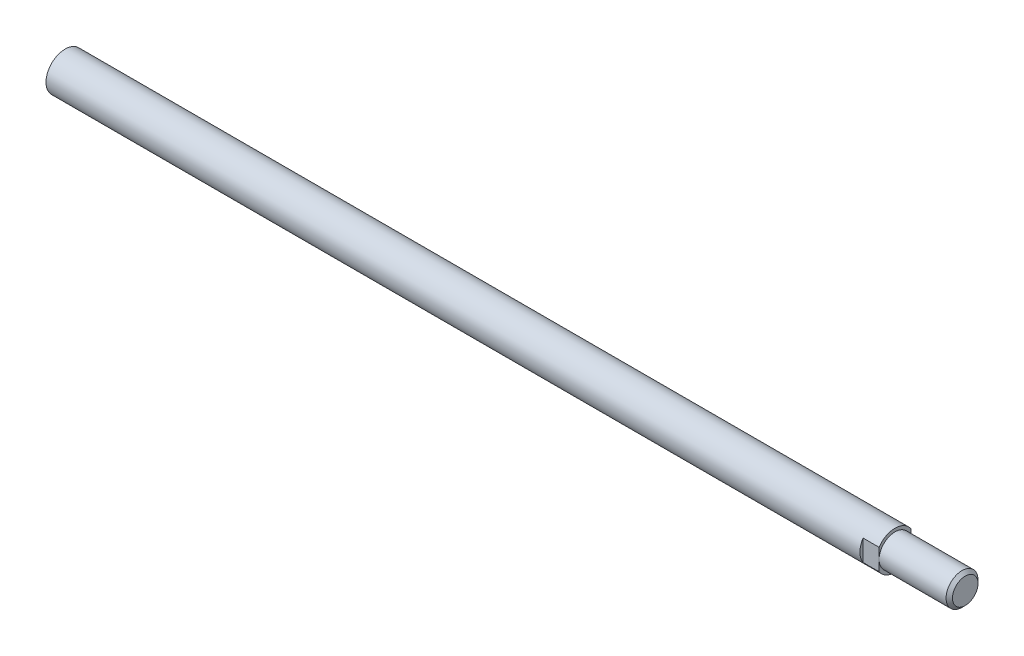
ISO-10303-21;
HEADER;
FILE_DESCRIPTION(('STEP AP214'),'2;1');
FILE_NAME('part.step','',(''),(''),'','','');
FILE_SCHEMA(('AUTOMOTIVE_DESIGN { 1 0 10303 214 1 1 1 1 }'));
ENDSEC;
DATA;
#1=APPLICATION_CONTEXT('core data for automotive mechanical design processes');
#2=APPLICATION_PROTOCOL_DEFINITION('international standard','automotive_design',2000,#1);
#3=PRODUCT_CONTEXT('',#1,'mechanical');
#4=PRODUCT('Part','Part','',(#3));
#5=PRODUCT_RELATED_PRODUCT_CATEGORY('part','',(#4));
#6=PRODUCT_DEFINITION_FORMATION('','',#4);
#7=PRODUCT_DEFINITION_CONTEXT('part definition',#1,'design');
#8=PRODUCT_DEFINITION('design','',#6,#7);
#9=PRODUCT_DEFINITION_SHAPE('','',#8);
#10=(LENGTH_UNIT() NAMED_UNIT(*) SI_UNIT(.MILLI.,.METRE.));
#11=(NAMED_UNIT(*) PLANE_ANGLE_UNIT() SI_UNIT($,.RADIAN.));
#12=(NAMED_UNIT(*) SI_UNIT($,.STERADIAN.) SOLID_ANGLE_UNIT());
#13=UNCERTAINTY_MEASURE_WITH_UNIT(LENGTH_MEASURE(1.E-05),#10,'distance_accuracy_value','');
#14=(GEOMETRIC_REPRESENTATION_CONTEXT(3) GLOBAL_UNCERTAINTY_ASSIGNED_CONTEXT((#13)) GLOBAL_UNIT_ASSIGNED_CONTEXT((#10,
#11,#12)) REPRESENTATION_CONTEXT('',''));
#15=CARTESIAN_POINT('',(0.,0.,0.));
#16=DIRECTION('',(0.,0.,1.));
#17=DIRECTION('',(1.,0.,0.));
#18=AXIS2_PLACEMENT_3D('',#15,#16,#17);
#19=CARTESIAN_POINT('',(0.,5.,0.));
#20=DIRECTION('',(1.,0.,0.));
#21=DIRECTION('',(0.,1.,0.));
#22=AXIS2_PLACEMENT_3D('',#19,#20,#21);
#23=PLANE('',#22);
#24=DIRECTION('',(0.,1.,0.));
#25=VECTOR('',#24,1.);
#26=CARTESIAN_POINT('',(0.,-6.,5.));
#27=LINE('',#26,#25);
#28=CARTESIAN_POINT('',(0.,-3.3166247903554,5.));
#29=VERTEX_POINT('',#28);
#30=CARTESIAN_POINT('',(0.,0.,5.));
#31=VERTEX_POINT('',#30);
#32=EDGE_CURVE('E82',#29,#31,#27,.T.);
#33=ORIENTED_EDGE('',*,*,#32,.F.);
#34=CARTESIAN_POINT('',(0.,0.,0.));
#35=DIRECTION('',(1.,0.,0.));
#36=DIRECTION('',(0.,1.,0.));
#37=AXIS2_PLACEMENT_3D('',#34,#35,#36);
#38=CIRCLE('',#37,6.);
#39=CARTESIAN_POINT('',(0.,-3.3166247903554,-5.));
#40=VERTEX_POINT('',#39);
#41=EDGE_CURVE('E91',#29,#40,#38,.T.);
#42=ORIENTED_EDGE('',*,*,#41,.T.);
#43=DIRECTION('',(0.,1.,0.));
#44=VECTOR('',#43,1.);
#45=CARTESIAN_POINT('',(0.,-6.,-5.));
#46=LINE('',#45,#44);
#47=CARTESIAN_POINT('',(0.,0.,-5.));
#48=VERTEX_POINT('',#47);
#49=EDGE_CURVE('E106',#40,#48,#46,.T.);
#50=ORIENTED_EDGE('',*,*,#49,.T.);
#51=CARTESIAN_POINT('',(0.,0.,0.));
#52=DIRECTION('',(1.,0.,0.));
#53=DIRECTION('',(0.,1.,0.));
#54=AXIS2_PLACEMENT_3D('',#51,#52,#53);
#55=CIRCLE('',#54,5.);
#56=EDGE_CURVE('E93',#31,#48,#55,.T.);
#57=ORIENTED_EDGE('',*,*,#56,.F.);
#58=EDGE_LOOP('',(#33,#42,#50,#57));
#59=FACE_BOUND('',#58,.T.);
#60=ADVANCED_FACE('F32',(#59),#23,.T.);
#61=CARTESIAN_POINT('',(22.,0.,0.));
#62=DIRECTION('',(1.,0.,0.));
#63=DIRECTION('',(0.,1.,0.));
#64=AXIS2_PLACEMENT_3D('',#61,#62,#63);
#65=PLANE('',#64);
#66=CARTESIAN_POINT('',(22.,0.,0.));
#67=DIRECTION('',(1.,0.,0.));
#68=DIRECTION('',(0.,1.,0.));
#69=AXIS2_PLACEMENT_3D('',#66,#67,#68);
#70=CIRCLE('',#69,4.00000000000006);
#71=CARTESIAN_POINT('',(22.,4.00000000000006,0.));
#72=VERTEX_POINT('',#71);
#73=EDGE_CURVE('E112',#72,#72,#70,.T.);
#74=ORIENTED_EDGE('',*,*,#73,.T.);
#75=EDGE_LOOP('',(#74));
#76=FACE_BOUND('',#75,.T.);
#77=ADVANCED_FACE('F138',(#76),#65,.T.);
#78=CARTESIAN_POINT('',(25.5329333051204,0.,0.));
#79=DIRECTION('',(1.,0.,0.));
#80=DIRECTION('',(0.,1.,0.));
#81=AXIS2_PLACEMENT_3D('',#78,#79,#80);
#82=CYLINDRICAL_SURFACE('',#81,5.);
#83=CARTESIAN_POINT('',(21.,0.,0.));
#84=DIRECTION('',(1.,0.,0.));
#85=DIRECTION('',(0.,1.,0.));
#86=AXIS2_PLACEMENT_3D('',#83,#84,#85);
#87=CIRCLE('',#86,5.);
#88=CARTESIAN_POINT('',(21.,5.,0.));
#89=VERTEX_POINT('',#88);
#90=EDGE_CURVE('E115',#89,#89,#87,.F.);
#91=ORIENTED_EDGE('',*,*,#90,.T.);
#92=EDGE_LOOP('',(#91));
#93=FACE_BOUND('',#92,.T.);
#94=EDGE_CURVE('E110',#48,#31,#55,.T.);
#95=ORIENTED_EDGE('',*,*,#94,.T.);
#96=ORIENTED_EDGE('',*,*,#56,.T.);
#97=EDGE_LOOP('',(#95,#96));
#98=FACE_BOUND('',#97,.T.);
#99=ADVANCED_FACE('F136',(#93,#98),#82,.T.);
#100=CARTESIAN_POINT('',(0.,3.3166247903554,5.));
#101=VERTEX_POINT('',#100);
#102=EDGE_CURVE('E95',#31,#101,#27,.T.);
#103=ORIENTED_EDGE('',*,*,#102,.F.);
#104=ORIENTED_EDGE('',*,*,#94,.F.);
#105=CARTESIAN_POINT('',(0.,3.3166247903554,-5.));
#106=VERTEX_POINT('',#105);
#107=EDGE_CURVE('E129',#48,#106,#46,.T.);
#108=ORIENTED_EDGE('',*,*,#107,.T.);
#109=EDGE_CURVE('E101',#106,#101,#38,.T.);
#110=ORIENTED_EDGE('',*,*,#109,.T.);
#111=EDGE_LOOP('',(#103,#104,#108,#110));
#112=FACE_BOUND('',#111,.T.);
#113=ADVANCED_FACE('F134',(#112),#23,.T.);
#114=CARTESIAN_POINT('',(25.5329333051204,0.,0.));
#115=DIRECTION('',(1.,0.,0.));
#116=DIRECTION('',(0.,1.,0.));
#117=AXIS2_PLACEMENT_3D('',#114,#115,#116);
#118=CYLINDRICAL_SURFACE('',#117,6.);
#119=CARTESIAN_POINT('',(-5.,0.,0.));
#120=DIRECTION('',(-1.,0.,0.));
#121=DIRECTION('',(0.,0.,1.));
#122=AXIS2_PLACEMENT_3D('',#119,#120,#121);
#123=CIRCLE('',#122,6.);
#124=CARTESIAN_POINT('',(-5.,3.3166247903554,5.));
#125=VERTEX_POINT('',#124);
#126=CARTESIAN_POINT('',(-5.,-3.3166247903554,5.));
#127=VERTEX_POINT('',#126);
#128=EDGE_CURVE('E40',#125,#127,#123,.F.);
#129=ORIENTED_EDGE('',*,*,#128,.F.);
#130=DIRECTION('',(1.,0.,0.));
#131=VECTOR('',#130,1.);
#132=CARTESIAN_POINT('',(25.5329333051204,3.3166247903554,5.));
#133=LINE('',#132,#131);
#134=EDGE_CURVE('E11',#101,#125,#133,.F.);
#135=ORIENTED_EDGE('',*,*,#134,.F.);
#136=ORIENTED_EDGE('',*,*,#109,.F.);
#137=DIRECTION('',(1.,0.,0.));
#138=VECTOR('',#137,1.);
#139=CARTESIAN_POINT('',(25.5329333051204,3.3166247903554,-5.));
#140=LINE('',#139,#138);
#141=CARTESIAN_POINT('',(-5.,3.3166247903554,-5.));
#142=VERTEX_POINT('',#141);
#143=EDGE_CURVE('E54',#142,#106,#140,.T.);
#144=ORIENTED_EDGE('',*,*,#143,.F.);
#145=CARTESIAN_POINT('',(-5.,0.,0.));
#146=DIRECTION('',(-1.,0.,0.));
#147=DIRECTION('',(0.,0.,1.));
#148=AXIS2_PLACEMENT_3D('',#145,#146,#147);
#149=CIRCLE('',#148,6.);
#150=CARTESIAN_POINT('',(-5.,-3.3166247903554,-5.));
#151=VERTEX_POINT('',#150);
#152=EDGE_CURVE('E118',#151,#142,#149,.F.);
#153=ORIENTED_EDGE('',*,*,#152,.F.);
#154=DIRECTION('',(1.,0.,0.));
#155=VECTOR('',#154,1.);
#156=CARTESIAN_POINT('',(25.5329333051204,-3.3166247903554,-5.));
#157=LINE('',#156,#155);
#158=EDGE_CURVE('E86',#40,#151,#157,.F.);
#159=ORIENTED_EDGE('',*,*,#158,.F.);
#160=ORIENTED_EDGE('',*,*,#41,.F.);
#161=DIRECTION('',(1.,0.,0.));
#162=VECTOR('',#161,1.);
#163=CARTESIAN_POINT('',(25.5329333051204,-3.3166247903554,5.));
#164=LINE('',#163,#162);
#165=EDGE_CURVE('E79',#127,#29,#164,.T.);
#166=ORIENTED_EDGE('',*,*,#165,.F.);
#167=EDGE_LOOP('',(#129,#135,#136,#144,#153,#159,#160,#166));
#168=FACE_BOUND('',#167,.T.);
#169=CARTESIAN_POINT('',(-260.,0.,0.));
#170=DIRECTION('',(1.,0.,0.));
#171=DIRECTION('',(0.,1.,0.));
#172=AXIS2_PLACEMENT_3D('',#169,#170,#171);
#173=CIRCLE('',#172,6.);
#174=CARTESIAN_POINT('',(-260.,5.99999999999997,0.));
#175=VERTEX_POINT('',#174);
#176=EDGE_CURVE('E102',#175,#175,#173,.T.);
#177=ORIENTED_EDGE('',*,*,#176,.T.);
#178=EDGE_LOOP('',(#177));
#179=FACE_BOUND('',#178,.T.);
#180=ADVANCED_FACE('F98',(#168,#179),#118,.T.);
#181=CARTESIAN_POINT('',(-260.,0.,0.));
#182=DIRECTION('',(-1.,0.,0.));
#183=DIRECTION('',(0.,-1.,0.));
#184=AXIS2_PLACEMENT_3D('',#181,#182,#183);
#185=PLANE('',#184);
#186=ORIENTED_EDGE('',*,*,#176,.F.);
#187=EDGE_LOOP('',(#186));
#188=FACE_BOUND('',#187,.T.);
#189=ADVANCED_FACE('F153',(#188),#185,.T.);
#190=CARTESIAN_POINT('',(22.,0.,0.));
#191=DIRECTION('',(-1.,0.,0.));
#192=DIRECTION('',(0.,-1.,0.));
#193=AXIS2_PLACEMENT_3D('',#190,#191,#192);
#194=CONICAL_SURFACE('',#193,4.00000000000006,0.78539816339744);
#195=ORIENTED_EDGE('',*,*,#90,.F.);
#196=EDGE_LOOP('',(#195));
#197=FACE_BOUND('',#196,.T.);
#198=ORIENTED_EDGE('',*,*,#73,.F.);
#199=EDGE_LOOP('',(#198));
#200=FACE_BOUND('',#199,.T.);
#201=ADVANCED_FACE('F34',(#197,#200),#194,.T.);
#202=CARTESIAN_POINT('',(0.,-6.,-5.));
#203=DIRECTION('',(0.,0.,1.));
#204=DIRECTION('',(1.,0.,0.));
#205=AXIS2_PLACEMENT_3D('',#202,#203,#204);
#206=PLANE('',#205);
#207=ORIENTED_EDGE('',*,*,#158,.T.);
#208=DIRECTION('',(0.,1.,0.));
#209=VECTOR('',#208,1.);
#210=CARTESIAN_POINT('',(-5.,-6.,-5.));
#211=LINE('',#210,#209);
#212=EDGE_CURVE('E130',#151,#142,#211,.T.);
#213=ORIENTED_EDGE('',*,*,#212,.T.);
#214=ORIENTED_EDGE('',*,*,#143,.T.);
#215=ORIENTED_EDGE('',*,*,#107,.F.);
#216=ORIENTED_EDGE('',*,*,#49,.F.);
#217=EDGE_LOOP('',(#207,#213,#214,#215,#216));
#218=FACE_BOUND('',#217,.T.);
#219=ADVANCED_FACE('F132',(#218),#206,.F.);
#220=CARTESIAN_POINT('',(-5.,-6.,-6.));
#221=DIRECTION('',(-1.,0.,0.));
#222=DIRECTION('',(0.,0.,1.));
#223=AXIS2_PLACEMENT_3D('',#220,#221,#222);
#224=PLANE('',#223);
#225=ORIENTED_EDGE('',*,*,#212,.F.);
#226=ORIENTED_EDGE('',*,*,#152,.T.);
#227=EDGE_LOOP('',(#225,#226));
#228=FACE_BOUND('',#227,.T.);
#229=ADVANCED_FACE('F157',(#228),#224,.F.);
#230=CARTESIAN_POINT('',(-5.,-6.,6.));
#231=DIRECTION('',(-1.,0.,0.));
#232=DIRECTION('',(0.,0.,1.));
#233=AXIS2_PLACEMENT_3D('',#230,#231,#232);
#234=PLANE('',#233);
#235=ORIENTED_EDGE('',*,*,#128,.T.);
#236=DIRECTION('',(0.,1.,0.));
#237=VECTOR('',#236,1.);
#238=CARTESIAN_POINT('',(-5.,-6.,5.));
#239=LINE('',#238,#237);
#240=EDGE_CURVE('E46',#127,#125,#239,.T.);
#241=ORIENTED_EDGE('',*,*,#240,.T.);
#242=EDGE_LOOP('',(#235,#241));
#243=FACE_BOUND('',#242,.T.);
#244=ADVANCED_FACE('F122',(#243),#234,.F.);
#245=CARTESIAN_POINT('',(0.,-6.,5.));
#246=DIRECTION('',(0.,0.,-1.));
#247=DIRECTION('',(-1.,0.,0.));
#248=AXIS2_PLACEMENT_3D('',#245,#246,#247);
#249=PLANE('',#248);
#250=ORIENTED_EDGE('',*,*,#134,.T.);
#251=ORIENTED_EDGE('',*,*,#240,.F.);
#252=ORIENTED_EDGE('',*,*,#165,.T.);
#253=ORIENTED_EDGE('',*,*,#32,.T.);
#254=ORIENTED_EDGE('',*,*,#102,.T.);
#255=EDGE_LOOP('',(#250,#251,#252,#253,#254));
#256=FACE_BOUND('',#255,.T.);
#257=ADVANCED_FACE('F81',(#256),#249,.F.);
#258=CLOSED_SHELL('',(#60,#77,#99,#113,#180,#189,#201,#219,#229,#244,#257));
#259=MANIFOLD_SOLID_BREP('B2',#258);
#260=ADVANCED_BREP_SHAPE_REPRESENTATION('',(#18,#259),#14);
#261=SHAPE_DEFINITION_REPRESENTATION(#9,#260);
ENDSEC;
END-ISO-10303-21;
